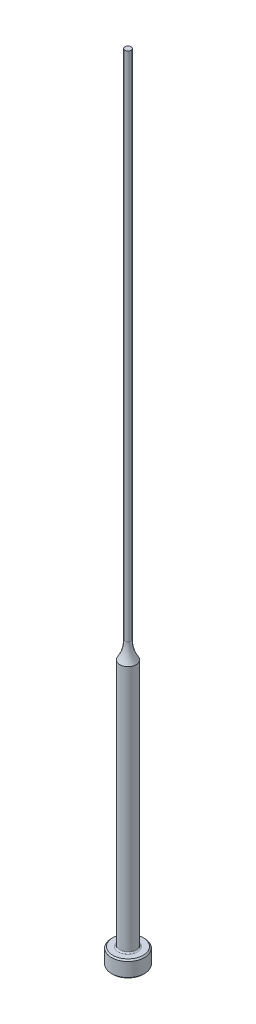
from build123d import *

# Parameters (mm, degrees)
CHAMFER1_SIZE = 0.254
FILLET1_R     = 0.254


with BuildPart() as part:
    # Sketch1 → Revolve1 (revolve)
    with BuildSketch(Plane.XY, mode=Mode.PRIVATE) as revolve1_sk:
        with BuildLine():
            Line((0, 0), (-3.175, 0))
            Line((-3.175, 0), (-3.175, 3.175))
            Line((-3.175, 3.175), (-1.5875, 3.175))
            Line((-1.5875, 3.175), (-1.5875, 50.8))
            ThreePointArc((-1.5875, 50.8), (-0.847698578, 52.434042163), (-0.59436, 54.209772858))
            Line((-0.59436, 54.209772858), (-0.59436, 152.4))
            Line((-0.59436, 152.4), (0, 152.4))
            Line((0, 152.4), (0, 0))
        make_face()
    revolve(revolve1_sk.sketch.rotate(Axis((0, 259.958771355, 0), (0, -1, 0)), 270), axis=Axis((0, 259.958771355, 0), (0, -1, 0)))

    # Chamfer1
    chamfer1_edges = [part.edges().sort_by_distance(p)[0] for p in [
        (0, 0, -3.175),
        (0, 3.175, -3.175),
    ]]
    chamfer(chamfer1_edges, length=CHAMFER1_SIZE)

    # Fillet1
    fillet1_edges = [part.edges().sort_by_distance(p)[0] for p in [
        (0, 3.175, -1.5875),
    ]]
    fillet(fillet1_edges, radius=FILLET1_R)


solid = part.part
